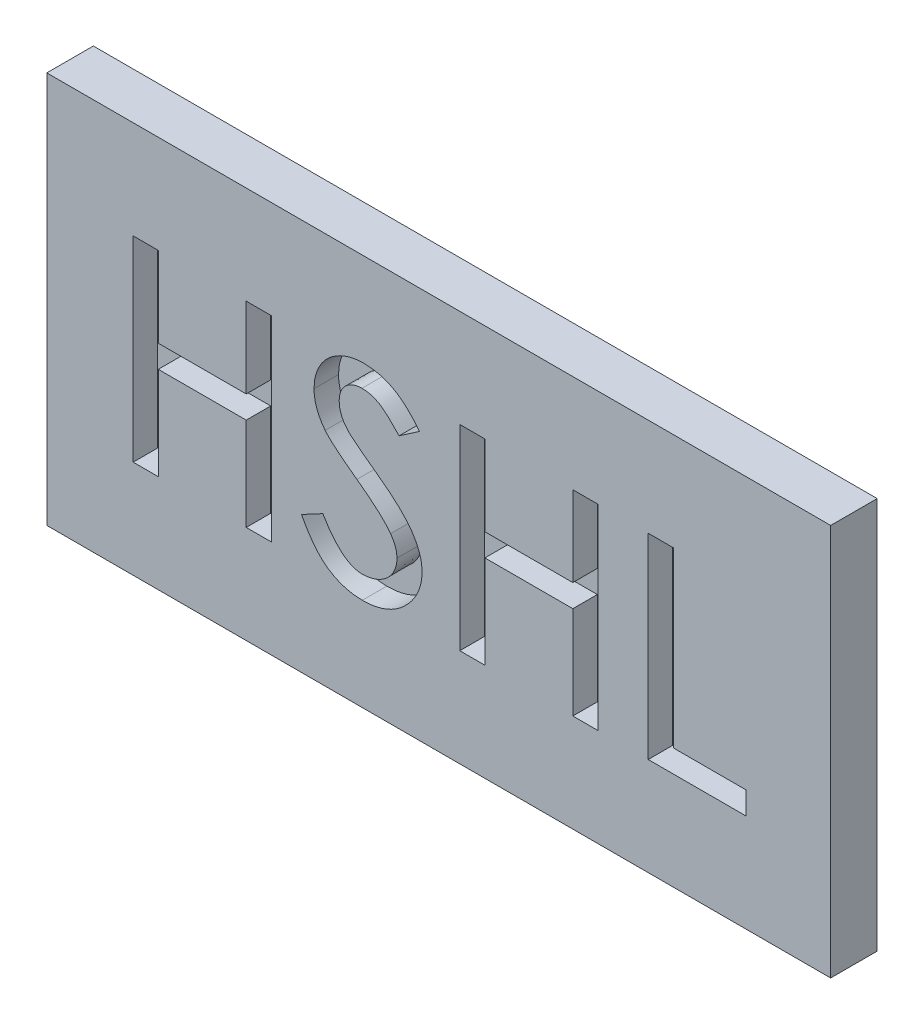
from build123d import *

# Parameters (mm, degrees)
SKIZZE1_W                       = 64
SKIZZE1_H                       = 32
AUFSATZ_LINEAR_AUSTRAGEN3_DEPTH = 4
SKIZZE2_W                       = 64
SKIZZE2_H                       = 32
AUFSATZ_LINEAR_AUSTRAGEN4_DEPTH = 2
FASE1_SIZE                      = 0.2


with BuildPart() as part:
    # Skizze1 → Aufsatz-Linear austragen3 (new body)
    with BuildSketch(Plane.XY):
        Rectangle(SKIZZE1_W, SKIZZE1_H)
        Polygon((-24.948717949, 8), (-22.897435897, 8), (-22.897435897, 1.435897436), (-15.717948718, 1.435897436), (-15.717948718, 8), (-13.666666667, 8), (-13.666666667, -8), (-15.717948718, -8), (-15.717948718, -0.41025641), (-22.897435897, -0.41025641), (-22.897435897, -8), (-24.948717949, -8), align=None, mode=Mode.SUBTRACT)
        with BuildLine():
            Line((-11.205128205, -4.826923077), (-9.461538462, -3.897435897))
            add(Edge.make_bspline(
                [(-9.461538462, -3.897435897), (-9.334473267, -4.107909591), (-9.091616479, -4.510183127), (-8.692833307, -5.052093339), (-8.296334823, -5.514200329), (-7.898207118, -5.896037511), (-7.492919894, -6.191471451), (-7.084610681, -6.404987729), (-6.670723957, -6.539189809), (-6.39088178, -6.555887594), (-6.253205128, -6.564102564)],
                knots=[0, 0, 0, 0, 1.354943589, 2.589672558, 3.704607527, 4.708856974, 5.624398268, 6.459549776, 7.242129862, 8, 8, 8, 8], degree=3))
            add(Edge.make_bspline(
                [(-6.253205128, -6.564102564), (-6.124676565, -6.559971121), (-5.870098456, -6.551787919), (-5.496045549, -6.480819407), (-5.133863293, -6.372688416), (-4.789827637, -6.218712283), (-4.47198595, -6.030072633), (-4.191401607, -5.805693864), (-3.953333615, -5.551664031), (-3.757110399, -5.271429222), (-3.603298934, -4.972223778), (-3.490070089, -4.662537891), (-3.423616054, -4.341479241), (-3.41474209, -4.125301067), (-3.41025641, -4.016025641)],
                knots=[0, 0, 0, 0, 1.0888553, 2.156709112, 3.216967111, 4.287545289, 5.343926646, 6.34269433, 7.323221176, 8.28571565, 9.233736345, 10.167849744, 11.073870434, 12, 12, 12, 12], degree=3))
            add(Edge.make_bspline(
                [(-3.41025641, -4.016025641), (-3.416541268, -3.891486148), (-3.429241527, -3.639820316), (-3.531176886, -3.265967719), (-3.696840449, -2.895773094), (-3.850082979, -2.664637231), (-3.929487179, -2.544871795)],
                knots=[0, 0, 0, 0, 0.941861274, 1.903286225, 2.913566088, 4, 4, 4, 4], degree=3))
            add(Edge.make_bspline(
                [(-3.929487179, -2.544871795), (-3.998148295, -2.457691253), (-4.142685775, -2.274168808), (-4.38734673, -1.997872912), (-4.673632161, -1.709655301), (-5.001077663, -1.410816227), (-5.363927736, -1.094659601), (-5.768345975, -0.769356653), (-6.211473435, -0.429409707), (-6.522004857, -0.20134671), (-6.682692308, -0.083333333)],
                knots=[0, 0, 0, 0, 0.718593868, 1.512701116, 2.388487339, 3.348232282, 4.383172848, 5.504845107, 6.708858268, 8, 8, 8, 8], degree=3))
            add(Edge.make_bspline(
                [(-6.682692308, -0.083333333), (-6.846551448, 0.035786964), (-7.160951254, 0.264345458), (-7.603913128, 0.599413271), (-8.001071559, 0.908364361), (-8.349380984, 1.191440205), (-8.648880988, 1.451101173), (-8.898940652, 1.686281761), (-9.107087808, 1.890527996), (-9.218940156, 2.027954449), (-9.269230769, 2.08974359)],
                knots=[0, 0, 0, 0, 1.435833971, 2.754963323, 3.936484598, 5.002077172, 5.935979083, 6.744956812, 7.435712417, 8, 8, 8, 8], degree=3))
            add(Edge.make_bspline(
                [(-9.269230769, 2.08974359), (-9.342648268, 2.184606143), (-9.48688285, 2.370971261), (-9.669488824, 2.669912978), (-9.826617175, 2.972767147), (-9.956035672, 3.282338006), (-10.056327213, 3.597636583), (-10.125323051, 3.919768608), (-10.173991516, 4.247454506), (-10.177648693, 4.468837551), (-10.179487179, 4.580128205)],
                knots=[0, 0, 0, 0, 1.064105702, 2.090521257, 3.104283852, 4.09061442, 5.065433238, 6.036507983, 7.012940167, 8, 8, 8, 8], degree=3))
            add(Edge.make_bspline(
                [(-10.179487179, 4.580128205), (-10.173697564, 4.753684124), (-10.16223455, 5.097312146), (-10.059796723, 5.598957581), (-9.893794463, 6.076936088), (-9.667203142, 6.528777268), (-9.377850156, 6.946070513), (-9.033676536, 7.320574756), (-8.632820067, 7.644298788), (-8.185976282, 7.917070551), (-7.704331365, 8.138290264), (-7.197046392, 8.295965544), (-6.670271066, 8.391553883), (-6.312361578, 8.403976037), (-6.131410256, 8.41025641)],
                knots=[0, 0, 0, 0, 1.004530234, 1.988896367, 2.951881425, 3.928924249, 4.907494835, 5.884204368, 6.865296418, 7.88218147, 8.909671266, 9.927572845, 10.952225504, 12, 12, 12, 12], degree=3))
            add(Edge.make_bspline(
                [(-6.131410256, 8.41025641), (-5.925950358, 8.402902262), (-5.519036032, 8.388337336), (-4.919206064, 8.289633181), (-4.345621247, 8.11192313), (-3.883661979, 7.915764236), (-3.52480413, 7.715207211), (-3.253392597, 7.534069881), (-2.975209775, 7.329073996), (-2.699066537, 7.090000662), (-2.414200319, 6.828417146), (-2.13519856, 6.530104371), (-1.844404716, 6.212159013), (-1.65906336, 5.982864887), (-1.564102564, 5.865384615)],
                knots=[0, 0, 0, 0, 1.360590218, 2.69465552, 4.010645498, 5.328858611, 6.009843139, 6.729980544, 7.488405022, 8.296451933, 9.147430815, 10.048128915, 10.999946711, 12, 12, 12, 12], degree=3))
            Line((-1.564102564, 5.865384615), (-3.237179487, 4.717948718))
            add(Edge.make_bspline(
                [(-3.237179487, 4.717948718), (-3.324492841, 4.811175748), (-3.492374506, 4.99042793), (-3.739324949, 5.244634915), (-3.972973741, 5.472767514), (-4.194029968, 5.673782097), (-4.397538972, 5.851263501), (-4.589219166, 5.999227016), (-4.763076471, 6.126394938), (-4.980413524, 6.25243238), (-5.246852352, 6.377257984), (-5.574776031, 6.489572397), (-5.918753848, 6.549597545), (-6.151503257, 6.559230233), (-6.269230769, 6.564102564)],
                knots=[0, 0, 0, 0, 1.253377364, 2.409930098, 3.477532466, 4.457083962, 5.341772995, 6.126101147, 6.832963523, 7.453284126, 8.588253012, 9.715448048, 10.844445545, 12, 12, 12, 12], degree=3))
            add(Edge.make_bspline(
                [(-6.269230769, 6.564102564), (-6.39489232, 6.558230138), (-6.639188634, 6.546813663), (-6.990107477, 6.449050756), (-7.312686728, 6.294784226), (-7.597292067, 6.076455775), (-7.833847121, 5.80622361), (-8.007331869, 5.48968086), (-8.108859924, 5.128938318), (-8.121574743, 4.875664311), (-8.128205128, 4.743589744)],
                knots=[0, 0, 0, 0, 1.033513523, 2.009234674, 2.977584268, 3.963375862, 4.942860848, 5.915719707, 6.913112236, 8, 8, 8, 8], degree=3))
            add(Edge.make_bspline(
                [(-8.128205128, 4.743589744), (-8.125621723, 4.658009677), (-8.120461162, 4.487056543), (-8.082555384, 4.233826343), (-8.01248657, 3.989145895), (-7.923695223, 3.747857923), (-7.799417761, 3.511318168), (-7.641142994, 3.279153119), (-7.453256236, 3.044674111), (-7.309060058, 2.897269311), (-7.233974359, 2.820512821)],
                knots=[0, 0, 0, 0, 0.940834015, 1.879392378, 2.805520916, 3.734846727, 4.701501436, 5.734192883, 6.820151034, 8, 8, 8, 8], degree=3))
            add(Edge.make_bspline(
                [(-7.233974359, 2.820512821), (-7.195955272, 2.784746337), (-7.108693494, 2.702654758), (-6.948646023, 2.5769482), (-6.753653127, 2.419345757), (-6.521011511, 2.232419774), (-6.243071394, 2.026318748), (-5.930109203, 1.787273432), (-5.574200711, 1.526045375), (-5.323746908, 1.342906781), (-5.192307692, 1.246794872)],
                knots=[0, 0, 0, 0, 0.485581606, 1.114511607, 1.892484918, 2.819534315, 3.891398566, 5.11240712, 6.484579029, 8, 8, 8, 8], degree=3))
            add(Edge.make_bspline(
                [(-5.192307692, 1.246794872), (-5.013236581, 1.116270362), (-4.666817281, 0.863766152), (-4.174716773, 0.48289678), (-3.730911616, 0.109551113), (-3.324181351, -0.24324569), (-2.968280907, -0.590292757), (-2.65654191, -0.924454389), (-2.385049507, -1.24246891), (-2.095092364, -1.64792853), (-1.805193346, -2.147790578), (-1.545963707, -2.751967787), (-1.391273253, -3.36091124), (-1.369647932, -3.767345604), (-1.358974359, -3.967948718)],
                knots=[0, 0, 0, 0, 1.186540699, 2.295404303, 3.331123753, 4.291760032, 5.17774712, 5.991329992, 6.738459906, 7.414799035, 8.65800623, 9.82461674, 10.926299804, 12, 12, 12, 12], degree=3))
            add(Edge.make_bspline(
                [(-1.358974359, -3.967948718), (-1.363515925, -4.110273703), (-1.372542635, -4.393155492), (-1.437988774, -4.811414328), (-1.546885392, -5.217947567), (-1.703552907, -5.611038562), (-1.898963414, -5.994376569), (-2.141259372, -6.364610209), (-2.429651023, -6.720312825), (-2.751971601, -7.063633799), (-3.108376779, -7.379159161), (-3.490580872, -7.656863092), (-3.89741698, -7.888855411), (-4.325750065, -8.077076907), (-4.773066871, -8.23045405), (-5.24378792, -8.335504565), (-5.735585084, -8.396141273), (-6.070344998, -8.405501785), (-6.240384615, -8.41025641)],
                knots=[0, 0, 0, 0, 0.932646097, 1.853705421, 2.767602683, 3.685675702, 4.622099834, 5.5835355, 6.579838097, 7.620108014, 8.666886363, 9.695041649, 10.711275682, 11.730160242, 12.757671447, 13.80585424, 14.885494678, 16, 16, 16, 16], degree=3))
            add(Edge.make_bspline(
                [(-6.240384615, -8.41025641), (-6.364379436, -8.407502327), (-6.608597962, -8.402077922), (-6.971159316, -8.367669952), (-7.323976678, -8.301538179), (-7.668984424, -8.216036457), (-8.006397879, -8.107161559), (-8.331868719, -7.967890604), (-8.650816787, -7.807918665), (-8.961412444, -7.620608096), (-9.264051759, -7.401282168), (-9.56045459, -7.146687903), (-9.848899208, -6.85234985), (-10.134330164, -6.522092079), (-10.412976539, -6.152199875), (-10.684187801, -5.74461825), (-10.951426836, -5.300661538), (-11.118894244, -4.987948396), (-11.205128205, -4.826923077)],
                knots=[0, 0, 0, 0, 0.916943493, 1.805999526, 2.689245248, 3.568702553, 4.433092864, 5.307568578, 6.183755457, 7.069823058, 7.986358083, 8.944343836, 9.955449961, 11.030835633, 12.170024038, 13.377301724, 14.649494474, 16, 16, 16, 16], degree=3))
        make_face(mode=Mode.SUBTRACT)
        Polygon((1.717948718, 8), (3.769230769, 8), (3.769230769, 1.435897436), (10.948717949, 1.435897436), (10.948717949, 8), (13, 8), (13, -8), (10.948717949, -8), (10.948717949, -0.41025641), (3.769230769, -0.41025641), (3.769230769, -8), (1.717948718, -8), align=None, mode=Mode.SUBTRACT)
        Polygon((17.102564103, 8), (19.153846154, 8), (19.153846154, -6.153846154), (25.102564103, -6.153846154), (25.102564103, -8), (17.102564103, -8), align=None, mode=Mode.SUBTRACT)
    extrude(amount=AUFSATZ_LINEAR_AUSTRAGEN3_DEPTH)

    # Skizze2 → Aufsatz-Linear austragen4 (add)
    with BuildSketch(Plane(origin=(0, 0, 0), x_dir=(-1, 0, 0), z_dir=(0, 0, -1))):
        Rectangle(SKIZZE2_W, SKIZZE2_H)
    extrude(amount=-AUFSATZ_LINEAR_AUSTRAGEN4_DEPTH)

    # Fase1
    fase1_edges = [part.edges().sort_by_distance(p)[0] for p in [
        (0, -16, 0),
        (-32, 0, 0),
        (0, 16, 0),
        (32, 0, 0),
    ]]
    chamfer(fase1_edges, length=FASE1_SIZE)


solid = part.part
